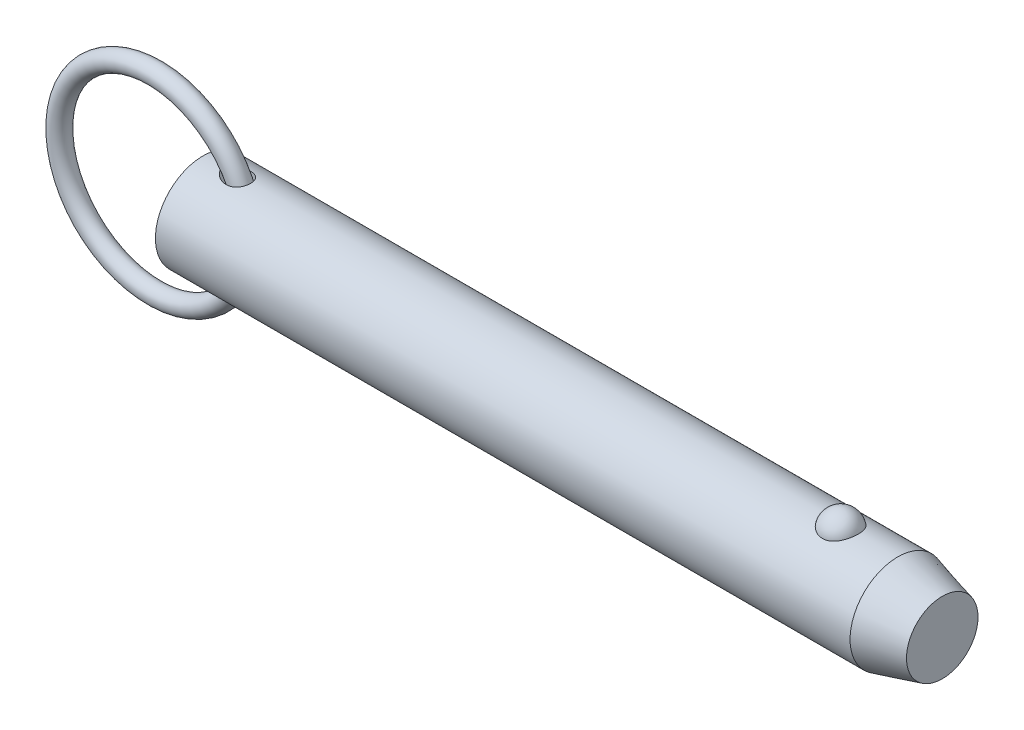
ISO-10303-21;
HEADER;
FILE_DESCRIPTION(('STEP AP214'),'2;1');
FILE_NAME('part.step','',(''),(''),'','','');
FILE_SCHEMA(('AUTOMOTIVE_DESIGN { 1 0 10303 214 1 1 1 1 }'));
ENDSEC;
DATA;
#1=APPLICATION_CONTEXT('core data for automotive mechanical design processes');
#2=APPLICATION_PROTOCOL_DEFINITION('international standard','automotive_design',2000,#1);
#3=PRODUCT_CONTEXT('',#1,'mechanical');
#4=PRODUCT('Part','Part','',(#3));
#5=PRODUCT_RELATED_PRODUCT_CATEGORY('part','',(#4));
#6=PRODUCT_DEFINITION_FORMATION('','',#4);
#7=PRODUCT_DEFINITION_CONTEXT('part definition',#1,'design');
#8=PRODUCT_DEFINITION('design','',#6,#7);
#9=PRODUCT_DEFINITION_SHAPE('','',#8);
#10=(LENGTH_UNIT() NAMED_UNIT(*) SI_UNIT(.MILLI.,.METRE.));
#11=(NAMED_UNIT(*) PLANE_ANGLE_UNIT() SI_UNIT($,.RADIAN.));
#12=(NAMED_UNIT(*) SI_UNIT($,.STERADIAN.) SOLID_ANGLE_UNIT());
#13=UNCERTAINTY_MEASURE_WITH_UNIT(LENGTH_MEASURE(1.E-05),#10,'distance_accuracy_value','');
#14=(GEOMETRIC_REPRESENTATION_CONTEXT(3) GLOBAL_UNCERTAINTY_ASSIGNED_CONTEXT((#13)) GLOBAL_UNIT_ASSIGNED_CONTEXT((#10,
#11,#12)) REPRESENTATION_CONTEXT('',''));
#15=CARTESIAN_POINT('',(0.,0.,0.));
#16=DIRECTION('',(0.,0.,1.));
#17=DIRECTION('',(1.,0.,0.));
#18=AXIS2_PLACEMENT_3D('',#15,#16,#17);
#19=CARTESIAN_POINT('',(-9.66825126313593,0.,0.));
#20=DIRECTION('',(0.,0.,1.));
#21=DIRECTION('',(1.,0.,0.));
#22=AXIS2_PLACEMENT_3D('',#19,#20,#21);
#23=TOROIDAL_SURFACE('',#22,19.05,1.905);
#24=CARTESIAN_POINT('',(11.2867487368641,0.,0.));
#25=VERTEX_POINT('',#24);
#26=VERTEX_LOOP('',#25);
#27=FACE_BOUND('',#26,.T.);
#28=ADVANCED_FACE('P0_F12',(#27),#23,.T.);
#29=CLOSED_SHELL('',(#28));
#30=MANIFOLD_SOLID_BREP('P0_B1',#29);
#31=CARTESIAN_POINT('',(0.,0.,0.));
#32=DIRECTION('',(1.,0.,0.));
#33=DIRECTION('',(0.,0.,-1.));
#34=AXIS2_PLACEMENT_3D('',#31,#32,#33);
#35=CYLINDRICAL_SURFACE('',#34,9.525);
#36=CARTESIAN_POINT('',(4.56693409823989,9.4314194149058,-1.33189820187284));
#37=CARTESIAN_POINT('',(4.70260475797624,9.41020313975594,-1.48215931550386));
#38=CARTESIAN_POINT('',(4.85555680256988,9.38755003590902,-1.61683982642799));
#39=CARTESIAN_POINT('',(5.10171959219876,9.35450554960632,-1.79512943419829));
#40=CARTESIAN_POINT('',(5.18674514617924,9.34362629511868,-1.85068909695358));
#41=CARTESIAN_POINT('',(5.36154389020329,9.32258514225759,-1.95392002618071));
#42=CARTESIAN_POINT('',(5.45131542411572,9.31242299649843,-2.00159402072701));
#43=CARTESIAN_POINT('',(5.70070211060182,9.28632120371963,-2.12033289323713));
#44=CARTESIAN_POINT('',(5.86420408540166,9.27146938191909,-2.18362944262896));
#45=CARTESIAN_POINT('',(6.19893345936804,9.24694163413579,-2.28525783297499));
#46=CARTESIAN_POINT('',(6.3701538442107,9.23726110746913,-2.32361187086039));
#47=CARTESIAN_POINT('',(6.73531776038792,9.22400982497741,-2.37575048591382));
#48=CARTESIAN_POINT('',(6.92975826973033,9.22118808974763,-2.38652934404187));
#49=CARTESIAN_POINT('',(7.21995443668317,9.22416297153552,-2.37494980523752));
#50=CARTESIAN_POINT('',(7.31643847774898,9.22635560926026,-2.366466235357));
#51=CARTESIAN_POINT('',(7.50796421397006,9.2331428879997,-2.33985028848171));
#52=CARTESIAN_POINT('',(7.60300650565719,9.23773650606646,-2.32172202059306));
#53=CARTESIAN_POINT('',(7.83273114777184,9.25183311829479,-2.26504721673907));
#54=CARTESIAN_POINT('',(7.96603028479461,9.26261470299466,-2.2209856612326));
#55=CARTESIAN_POINT('',(8.22310899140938,9.28816519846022,-2.1115730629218));
#56=CARTESIAN_POINT('',(8.34689477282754,9.30293147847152,-2.04623606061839));
#57=CARTESIAN_POINT('',(8.58136049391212,9.3349416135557,-1.89485344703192));
#58=CARTESIAN_POINT('',(8.69199721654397,9.35219324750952,-1.8087422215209));
#59=CARTESIAN_POINT('',(8.89592093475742,9.38707016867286,-1.6179918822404));
#60=CARTESIAN_POINT('',(8.98920771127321,9.40469546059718,-1.51335253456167));
#61=CARTESIAN_POINT('',(9.15057731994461,9.43713590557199,-1.29519427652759));
#62=CARTESIAN_POINT('',(9.21980158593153,9.45205440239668,-1.18253282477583));
#63=CARTESIAN_POINT('',(9.33826736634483,9.47856708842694,-0.946802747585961));
#64=CARTESIAN_POINT('',(9.38751161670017,9.49016173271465,-0.823735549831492));
#65=CARTESIAN_POINT('',(9.46423850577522,9.50859378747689,-0.572614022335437));
#66=CARTESIAN_POINT('',(9.4920239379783,9.5154972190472,-0.444656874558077));
#67=CARTESIAN_POINT('',(9.52636926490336,9.5240690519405,-0.185752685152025));
#68=CARTESIAN_POINT('',(9.5329292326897,9.52573747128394,-0.054805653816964));
#69=CARTESIAN_POINT('',(9.52467276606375,9.52365852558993,0.206503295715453));
#70=CARTESIAN_POINT('',(9.50983454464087,9.51990564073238,0.336864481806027));
#71=CARTESIAN_POINT('',(9.45907362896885,9.50737852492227,0.593166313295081));
#72=CARTESIAN_POINT('',(9.42315106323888,9.49860432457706,0.719106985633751));
#73=CARTESIAN_POINT('',(9.3310664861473,9.4769892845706,0.962959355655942));
#74=CARTESIAN_POINT('',(9.27490839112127,9.46414923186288,1.08087260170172));
#75=CARTESIAN_POINT('',(9.1437580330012,9.43581000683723,1.30534632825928));
#76=CARTESIAN_POINT('',(9.06876720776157,9.42031103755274,1.41190767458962));
#77=CARTESIAN_POINT('',(8.90203187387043,9.38836719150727,1.61069439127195));
#78=CARTESIAN_POINT('',(8.81029913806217,9.371922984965,1.70292975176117));
#79=CARTESIAN_POINT('',(8.6126877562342,9.33985045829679,1.87086859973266));
#80=CARTESIAN_POINT('',(8.50680947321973,9.3242221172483,1.94657251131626));
#81=CARTESIAN_POINT('',(8.28220546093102,9.29513431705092,2.08109032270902));
#82=CARTESIAN_POINT('',(8.16329919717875,9.28171415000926,2.13961034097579));
#83=CARTESIAN_POINT('',(7.91756052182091,9.25859072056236,2.23755716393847));
#84=CARTESIAN_POINT('',(7.79072606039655,9.24888842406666,2.27697900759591));
#85=CARTESIAN_POINT('',(7.52377913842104,9.23338749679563,2.33907806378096));
#86=CARTESIAN_POINT('',(7.3833476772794,9.22789571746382,2.36044900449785));
#87=CARTESIAN_POINT('',(7.1008139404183,9.22210229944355,2.3829751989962));
#88=CARTESIAN_POINT('',(6.95871103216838,9.22180269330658,2.38412253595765));
#89=CARTESIAN_POINT('',(6.65642691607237,9.22632724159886,2.36656230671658));
#90=CARTESIAN_POINT('',(6.49641694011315,9.23185415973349,2.3451317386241));
#91=CARTESIAN_POINT('',(6.18115433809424,9.24811737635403,2.28014143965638));
#92=CARTESIAN_POINT('',(6.02590710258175,9.25885936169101,2.23655754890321));
#93=CARTESIAN_POINT('',(5.69904720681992,9.28624254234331,2.12025087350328));
#94=CARTESIAN_POINT('',(5.52873601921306,9.30354853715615,2.04400672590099));
#95=CARTESIAN_POINT('',(5.20289495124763,9.34106989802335,1.86504730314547));
#96=CARTESIAN_POINT('',(5.0473596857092,9.36128419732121,1.76234172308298));
#97=CARTESIAN_POINT('',(4.79287124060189,9.39697639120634,1.55895334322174));
#98=CARTESIAN_POINT('',(4.6893870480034,9.41240250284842,1.46392900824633));
#99=CARTESIAN_POINT('',(4.4984714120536,9.44202586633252,1.25875918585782));
#100=CARTESIAN_POINT('',(4.41101129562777,9.45622528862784,1.1486413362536));
#101=CARTESIAN_POINT('',(4.27502257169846,9.47888210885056,0.94060098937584));
#102=CARTESIAN_POINT('',(4.22216329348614,9.48791121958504,0.845586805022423));
#103=CARTESIAN_POINT('',(4.13241478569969,9.50344321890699,0.648051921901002));
#104=CARTESIAN_POINT('',(4.09551182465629,9.50994827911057,0.545537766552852));
#105=CARTESIAN_POINT('',(4.04043124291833,9.51971586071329,0.334452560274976));
#106=CARTESIAN_POINT('',(4.0224072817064,9.52295176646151,0.225839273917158));
#107=CARTESIAN_POINT('',(4.00750873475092,9.52562364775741,0.00713006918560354));
#108=CARTESIAN_POINT('',(4.01062334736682,9.52506156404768,-0.102965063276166));
#109=CARTESIAN_POINT('',(4.03592967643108,9.52053221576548,-0.306944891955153));
#110=CARTESIAN_POINT('',(4.05571676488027,9.51699426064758,-0.401151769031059));
#111=CARTESIAN_POINT('',(4.10967975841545,9.5074546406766,-0.585176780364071));
#112=CARTESIAN_POINT('',(4.14385995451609,9.50145224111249,-0.674993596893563));
#113=CARTESIAN_POINT('',(4.23261356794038,9.48611703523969,-0.866116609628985));
#114=CARTESIAN_POINT('',(4.28990016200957,9.47635800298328,-0.966121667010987));
#115=CARTESIAN_POINT('',(4.4185657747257,9.45502867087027,-1.15640011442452));
#116=CARTESIAN_POINT('',(4.48996918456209,9.44345524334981,-1.24665623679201));
#117=CARTESIAN_POINT('',(4.56693409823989,9.4314194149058,-1.33189820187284));
#118=B_SPLINE_CURVE_WITH_KNOTS('',3,(#36,#37,#38,#39,#40,#41,#42,#43,#44,#45,#46,#47,#48,#49,
#50,#51,#52,#53,#54,#55,#56,#57,#58,#59,#60,#61,#62,#63,#64,#65,#66,#67,#68,#69,#70,#71,#72,#73,
#74,#75,#76,#77,#78,#79,#80,#81,#82,#83,#84,#85,#86,#87,#88,#89,#90,#91,#92,#93,#94,#95,#96,#97,
#98,#99,#100,#101,#102,#103,#104,#105,#106,#107,#108,#109,#110,#111,#112,#113,#114,#115,#116,
#117),.UNSPECIFIED.,.T.,.F.,(4,2,2,2,2,2,2,2,2,2,2,2,2,2,2,2,2,2,2,2,2,2,2,2,2,2,2,2,2,2,2,2,2,
2,2,2,2,2,2,2,4),(0.,0.609951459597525,0.916123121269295,1.22218863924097,1.74791337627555,
2.27316961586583,2.85362722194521,3.14383229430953,3.43391382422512,3.85437497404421,
4.27455920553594,4.69608835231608,5.11762282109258,5.51490051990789,5.91212379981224,
6.30363414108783,6.69514313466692,7.0870510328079,7.47895654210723,7.87078624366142,
8.26258603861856,8.65411137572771,9.0456266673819,9.44349251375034,9.84146165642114,
10.2662286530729,10.6911619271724,11.1739180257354,11.6572017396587,12.2170157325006,
12.776624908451,13.1992556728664,13.6211226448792,13.9471990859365,14.2729943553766,
14.6014211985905,14.9296802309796,15.2173810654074,15.505167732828,15.8505863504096,
16.1966070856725),.UNSPECIFIED.);
#119=CARTESIAN_POINT('',(4.56693409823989,9.4314194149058,-1.33189820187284));
#120=VERTEX_POINT('',#119);
#121=EDGE_CURVE('P1_E40',#120,#120,#118,.T.);
#122=ORIENTED_EDGE('',*,*,#121,.T.);
#123=EDGE_LOOP('',(#122));
#124=FACE_BOUND('',#123,.T.);
#125=CARTESIAN_POINT('',(138.743054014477,0.,0.));
#126=DIRECTION('',(1.,0.,0.));
#127=DIRECTION('',(0.,0.,-1.));
#128=AXIS2_PLACEMENT_3D('',#125,#126,#127);
#129=CIRCLE('',#128,9.525);
#130=CARTESIAN_POINT('',(138.743054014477,0.,-9.525));
#131=VERTEX_POINT('',#130);
#132=EDGE_CURVE('P1_E25',#131,#131,#129,.T.);
#133=ORIENTED_EDGE('',*,*,#132,.F.);
#134=EDGE_LOOP('',(#133));
#135=FACE_BOUND('',#134,.T.);
#136=CARTESIAN_POINT('',(0.,0.,0.));
#137=DIRECTION('',(1.,0.,0.));
#138=DIRECTION('',(0.,0.,-1.));
#139=AXIS2_PLACEMENT_3D('',#136,#137,#138);
#140=CIRCLE('',#139,9.525);
#141=CARTESIAN_POINT('',(0.,0.,-9.525));
#142=VERTEX_POINT('',#141);
#143=EDGE_CURVE('P1_E9',#142,#142,#140,.T.);
#144=ORIENTED_EDGE('',*,*,#143,.T.);
#145=EDGE_LOOP('',(#144));
#146=FACE_BOUND('',#145,.T.);
#147=CARTESIAN_POINT('',(127.345757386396,8.80405803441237,3.63513233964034));
#148=CARTESIAN_POINT('',(127.251676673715,8.80405953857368,3.63513053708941));
#149=CARTESIAN_POINT('',(127.157561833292,8.80561325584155,3.63137461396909));
#150=CARTESIAN_POINT('',(126.970012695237,8.81177748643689,3.61638665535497));
#151=CARTESIAN_POINT('',(126.876578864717,8.81638992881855,3.60514990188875));
#152=CARTESIAN_POINT('',(126.597945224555,8.83467114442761,3.56024627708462));
#153=CARTESIAN_POINT('',(126.414691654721,8.85278327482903,3.51538626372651));
#154=CARTESIAN_POINT('',(126.059509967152,8.89871214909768,3.39742145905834));
#155=CARTESIAN_POINT('',(125.887553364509,8.92650327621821,3.32439116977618));
#156=CARTESIAN_POINT('',(125.558707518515,8.98874819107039,3.15220244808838));
#157=CARTESIAN_POINT('',(125.401811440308,9.02319893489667,3.05305594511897));
#158=CARTESIAN_POINT('',(125.102214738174,9.09629186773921,2.82797815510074));
#159=CARTESIAN_POINT('',(124.960060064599,9.13502685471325,2.70135138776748));
#160=CARTESIAN_POINT('',(124.698299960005,9.2118657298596,2.42641932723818));
#161=CARTESIAN_POINT('',(124.578701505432,9.24996941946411,2.27810735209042));
#162=CARTESIAN_POINT('',(124.359645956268,9.32341082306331,1.95652290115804));
#163=CARTESIAN_POINT('',(124.261317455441,9.35855090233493,1.78243511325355));
#164=CARTESIAN_POINT('',(124.093819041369,9.42045142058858,1.41937246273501));
#165=CARTESIAN_POINT('',(124.024651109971,9.44721128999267,1.23039658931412));
#166=CARTESIAN_POINT('',(123.916199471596,9.48990641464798,0.840370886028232));
#167=CARTESIAN_POINT('',(123.877288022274,9.50570658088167,0.639202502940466));
#168=CARTESIAN_POINT('',(123.831555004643,9.52433146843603,0.232664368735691));
#169=CARTESIAN_POINT('',(123.824732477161,9.52715657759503,0.027294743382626));
#170=CARTESIAN_POINT('',(123.843255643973,9.51956918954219,-0.380478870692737));
#171=CARTESIAN_POINT('',(123.868405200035,9.50923740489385,-0.58289331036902));
#172=CARTESIAN_POINT('',(123.95002537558,9.47651897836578,-0.980293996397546));
#173=CARTESIAN_POINT('',(124.006496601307,9.45413210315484,-1.17528009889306));
#174=CARTESIAN_POINT('',(124.149719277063,9.39954044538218,-1.55263697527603));
#175=CARTESIAN_POINT('',(124.236512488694,9.36732213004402,-1.73498993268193));
#176=CARTESIAN_POINT('',(124.438610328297,9.29640700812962,-2.08177763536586));
#177=CARTESIAN_POINT('',(124.553917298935,9.25770966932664,-2.24621090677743));
#178=CARTESIAN_POINT('',(124.811264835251,9.17775604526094,-2.5533833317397));
#179=CARTESIAN_POINT('',(124.953434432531,9.136488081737,-2.696011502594));
#180=CARTESIAN_POINT('',(125.26089985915,9.05620497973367,-2.95451229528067));
#181=CARTESIAN_POINT('',(125.426193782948,9.01718965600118,-3.07038711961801));
#182=CARTESIAN_POINT('',(125.772052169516,8.94680019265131,-3.26976836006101));
#183=CARTESIAN_POINT('',(125.952227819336,8.91528408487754,-3.35389750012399));
#184=CARTESIAN_POINT('',(126.325651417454,8.86272514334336,-3.49043503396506));
#185=CARTESIAN_POINT('',(126.518894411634,8.84167836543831,-3.54285537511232));
#186=CARTESIAN_POINT('',(126.902503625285,8.81348056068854,-3.61241306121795));
#187=CARTESIAN_POINT('',(127.092525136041,8.80568348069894,-3.6311933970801));
#188=CARTESIAN_POINT('',(127.473190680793,8.80289410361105,-3.63795342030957));
#189=CARTESIAN_POINT('',(127.663834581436,8.80789922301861,-3.62593932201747));
#190=CARTESIAN_POINT('',(128.034007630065,8.82974915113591,-3.57238430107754));
#191=CARTESIAN_POINT('',(128.213697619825,8.84621463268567,-3.53178890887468));
#192=CARTESIAN_POINT('',(128.563422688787,8.88875330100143,-3.42331083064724));
#193=CARTESIAN_POINT('',(128.733456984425,8.91482726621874,-3.35542593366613));
#194=CARTESIAN_POINT('',(129.063237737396,8.97448239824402,-3.19248225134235));
#195=CARTESIAN_POINT('',(129.222680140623,9.00821446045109,-3.0968647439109));
#196=CARTESIAN_POINT('',(129.523513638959,9.07935398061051,-2.88162736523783));
#197=CARTESIAN_POINT('',(129.664900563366,9.11676228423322,-2.76200196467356));
#198=CARTESIAN_POINT('',(129.93331931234,9.19347419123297,-2.49516285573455));
#199=CARTESIAN_POINT('',(130.059275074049,9.23277872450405,-2.34686614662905));
#200=CARTESIAN_POINT('',(130.285522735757,9.3073761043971,-2.03093683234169));
#201=CARTESIAN_POINT('',(130.38581004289,9.34266823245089,-1.86330077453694));
#202=CARTESIAN_POINT('',(130.561514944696,9.40674710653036,-1.50744893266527));
#203=CARTESIAN_POINT('',(130.636041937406,9.43529176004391,-1.31874876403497));
#204=CARTESIAN_POINT('',(130.75416505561,9.48144132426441,-0.930631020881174));
#205=CARTESIAN_POINT('',(130.797760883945,9.49904612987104,-0.731213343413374));
#206=CARTESIAN_POINT('',(130.853158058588,9.5215314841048,-0.327147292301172));
#207=CARTESIAN_POINT('',(130.864935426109,9.52640243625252,-0.12249509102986));
#208=CARTESIAN_POINT('',(130.856382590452,9.5228957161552,0.286018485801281));
#209=CARTESIAN_POINT('',(130.83605305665,9.5145183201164,0.489879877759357));
#210=CARTESIAN_POINT('',(130.763884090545,9.48544083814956,0.88999431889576));
#211=CARTESIAN_POINT('',(130.712199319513,9.46480124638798,1.08627971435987));
#212=CARTESIAN_POINT('',(130.578491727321,9.4133389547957,1.46682086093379));
#213=CARTESIAN_POINT('',(130.496466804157,9.38251554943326,1.65107577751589));
#214=CARTESIAN_POINT('',(130.30319292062,9.31365636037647,2.00346348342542));
#215=CARTESIAN_POINT('',(130.191783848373,9.27558138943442,2.17150083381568));
#216=CARTESIAN_POINT('',(129.942294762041,9.19638714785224,2.48563115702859));
#217=CARTESIAN_POINT('',(129.804216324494,9.15526805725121,2.63172542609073));
#218=CARTESIAN_POINT('',(129.504843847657,9.07465393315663,2.89750997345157));
#219=CARTESIAN_POINT('',(129.343610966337,9.03515496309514,3.01726776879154));
#220=CARTESIAN_POINT('',(129.001613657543,8.96227564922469,3.22732920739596));
#221=CARTESIAN_POINT('',(128.820841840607,8.92889763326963,3.31762165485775));
#222=CARTESIAN_POINT('',(128.451445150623,8.8734538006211,3.46314419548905));
#223=CARTESIAN_POINT('',(128.26332371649,8.85102983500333,3.51950082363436));
#224=CARTESIAN_POINT('',(127.97578699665,8.82666967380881,3.57993683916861));
#225=CARTESIAN_POINT('',(127.879133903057,8.82009725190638,3.59606217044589));
#226=CARTESIAN_POINT('',(127.684677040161,8.81020897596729,3.62022512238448));
#227=CARTESIAN_POINT('',(127.586874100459,8.80689090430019,3.62826825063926));
#228=CARTESIAN_POINT('',(127.441224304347,8.80445615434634,3.63416760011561));
#229=CARTESIAN_POINT('',(127.393495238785,8.80405727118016,3.63513325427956));
#230=CARTESIAN_POINT('',(127.345757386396,8.80405803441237,3.63513233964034));
#231=B_SPLINE_CURVE_WITH_KNOTS('',3,(#147,#148,#149,#150,#151,#152,#153,#154,#155,#156,#157,
#158,#159,#160,#161,#162,#163,#164,#165,#166,#167,#168,#169,#170,#171,#172,#173,#174,#175,#176,
#177,#178,#179,#180,#181,#182,#183,#184,#185,#186,#187,#188,#189,#190,#191,#192,#193,#194,#195,
#196,#197,#198,#199,#200,#201,#202,#203,#204,#205,#206,#207,#208,#209,#210,#211,#212,#213,#214,
#215,#216,#217,#218,#219,#220,#221,#222,#223,#224,#225,#226,#227,#228,#229,#230),.UNSPECIFIED.,
.T.,.F.,(4,2,2,2,2,2,2,2,2,2,2,2,2,2,2,2,2,2,2,2,2,2,2,2,2,2,2,2,2,2,2,2,2,2,2,2,2,2,2,2,2,4),
(0.,0.282202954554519,0.564584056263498,1.13017050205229,1.69427128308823,2.25811483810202,
2.83836627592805,3.41879688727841,4.02497117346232,4.63118665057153,5.24474754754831,
5.85829010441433,6.46808687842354,7.07789545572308,7.68854723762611,8.29924920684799,
8.9129628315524,9.52662591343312,10.1275338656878,10.7282152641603,11.2986646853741,
11.8689989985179,12.4213015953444,12.973648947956,13.5380053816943,14.1024919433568,
14.695298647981,15.2882113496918,15.8999469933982,16.5116885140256,17.1238909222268,
17.7360805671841,18.3452748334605,18.9545113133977,19.567138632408,20.179729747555,
20.7907316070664,21.4019653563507,21.9915938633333,22.2859053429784,22.5800161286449,
22.7232098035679),.UNSPECIFIED.);
#232=CARTESIAN_POINT('',(127.345757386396,8.80405803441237,3.63513233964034));
#233=VERTEX_POINT('',#232);
#234=EDGE_CURVE('P1_E34',#233,#233,#231,.T.);
#235=ORIENTED_EDGE('',*,*,#234,.T.);
#236=EDGE_LOOP('',(#235));
#237=FACE_BOUND('',#236,.T.);
#238=CARTESIAN_POINT('',(4.56693409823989,-9.4314194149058,-1.33189820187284));
#239=CARTESIAN_POINT('',(4.48932984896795,-9.4435553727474,-1.24594548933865));
#240=CARTESIAN_POINT('',(4.41737309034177,-9.45522193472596,-1.1548795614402));
#241=CARTESIAN_POINT('',(4.2878104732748,-9.47670896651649,-0.962782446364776));
#242=CARTESIAN_POINT('',(4.23019403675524,-9.48653079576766,-0.861758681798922));
#243=CARTESIAN_POINT('',(4.13254559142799,-9.5034118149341,-0.649723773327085));
#244=CARTESIAN_POINT('',(4.09271158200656,-9.51043980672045,-0.538615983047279));
#245=CARTESIAN_POINT('',(4.04973167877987,-9.51806966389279,-0.367764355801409));
#246=CARTESIAN_POINT('',(4.03820037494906,-9.52012756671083,-0.310118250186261));
#247=CARTESIAN_POINT('',(4.02100287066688,-9.52320274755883,-0.193935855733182));
#248=CARTESIAN_POINT('',(4.01533565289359,-9.52422020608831,-0.135399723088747));
#249=CARTESIAN_POINT('',(4.0081707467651,-9.52550497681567,0.0247266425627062));
#250=CARTESIAN_POINT('',(4.01270492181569,-9.52468821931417,0.126661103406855));
#251=CARTESIAN_POINT('',(4.03954973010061,-9.51988506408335,0.328012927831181));
#252=CARTESIAN_POINT('',(4.06186450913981,-9.51589792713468,0.427429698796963));
#253=CARTESIAN_POINT('',(4.12088980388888,-9.50548528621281,0.616362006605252));
#254=CARTESIAN_POINT('',(4.15684838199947,-9.49918763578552,0.706123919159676));
#255=CARTESIAN_POINT('',(4.24094647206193,-9.48470618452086,0.879522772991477));
#256=CARTESIAN_POINT('',(4.28909090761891,-9.47652162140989,0.963157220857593));
#257=CARTESIAN_POINT('',(4.42295891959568,-9.45426317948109,1.16513741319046));
#258=CARTESIAN_POINT('',(4.51523752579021,-9.43933320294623,1.27905352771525));
#259=CARTESIAN_POINT('',(4.71682295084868,-9.40825940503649,1.49055892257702));
#260=CARTESIAN_POINT('',(4.82617286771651,-9.39211256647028,1.58810554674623));
#261=CARTESIAN_POINT('',(5.09064226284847,-9.35555264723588,1.79246125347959));
#262=CARTESIAN_POINT('',(5.2499041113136,-9.33524115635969,1.89393122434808));
#263=CARTESIAN_POINT('',(5.58309255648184,-9.29785396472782,2.06968659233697));
#264=CARTESIAN_POINT('',(5.7570289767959,-9.28078045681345,2.14395359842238));
#265=CARTESIAN_POINT('',(6.11646882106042,-9.25213303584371,2.26440412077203));
#266=CARTESIAN_POINT('',(6.30205582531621,-9.2406056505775,2.31035092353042));
#267=CARTESIAN_POINT('',(6.67856093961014,-9.22541807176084,2.37029728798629));
#268=CARTESIAN_POINT('',(6.8694704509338,-9.2217458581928,2.3843456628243));
#269=CARTESIAN_POINT('',(7.21217144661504,-9.2234423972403,2.37775005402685));
#270=CARTESIAN_POINT('',(7.36409439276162,-9.22713860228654,2.36352577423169));
#271=CARTESIAN_POINT('',(7.66346227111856,-9.24048072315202,2.31082299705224));
#272=CARTESIAN_POINT('',(7.81090958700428,-9.25012341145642,2.27235765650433));
#273=CARTESIAN_POINT('',(8.09730316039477,-9.2746609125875,2.17003648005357));
#274=CARTESIAN_POINT('',(8.23619652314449,-9.28958517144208,2.10603803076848));
#275=CARTESIAN_POINT('',(8.49918675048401,-9.32290326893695,1.95324442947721));
#276=CARTESIAN_POINT('',(8.62328895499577,-9.34129584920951,1.86445826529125));
#277=CARTESIAN_POINT('',(8.84006515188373,-9.37706953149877,1.67466761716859));
#278=CARTESIAN_POINT('',(8.93465172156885,-9.39436331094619,1.57582357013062));
#279=CARTESIAN_POINT('',(9.1049023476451,-9.42761680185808,1.362809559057));
#280=CARTESIAN_POINT('',(9.18057146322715,-9.44357686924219,1.24864370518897));
#281=CARTESIAN_POINT('',(9.30789178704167,-9.47159985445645,1.01379272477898));
#282=CARTESIAN_POINT('',(9.36045544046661,-9.48380365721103,0.893617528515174));
#283=CARTESIAN_POINT('',(9.44498362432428,-9.50388751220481,0.645890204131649));
#284=CARTESIAN_POINT('',(9.47694947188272,-9.51176784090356,0.518338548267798));
#285=CARTESIAN_POINT('',(9.51944262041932,-9.52232073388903,0.260103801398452));
#286=CARTESIAN_POINT('',(9.53006646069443,-9.52501674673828,0.129437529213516));
#287=CARTESIAN_POINT('',(9.52993291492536,-9.52498309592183,-0.131885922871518));
#288=CARTESIAN_POINT('',(9.5191752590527,-9.52225336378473,-0.262543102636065));
#289=CARTESIAN_POINT('',(9.47648788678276,-9.51165418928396,-0.520312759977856));
#290=CARTESIAN_POINT('',(9.44453086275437,-9.50377811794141,-0.647420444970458));
#291=CARTESIAN_POINT('',(9.36015568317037,-9.48373425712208,-0.894290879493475));
#292=CARTESIAN_POINT('',(9.30773827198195,-9.47156662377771,-1.01405389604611));
#293=CARTESIAN_POINT('',(9.18380895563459,-9.44428888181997,-1.24269386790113));
#294=CARTESIAN_POINT('',(9.11232064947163,-9.42918241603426,-1.35158405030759));
#295=CARTESIAN_POINT('',(8.95212687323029,-9.39767706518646,-1.55562459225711));
#296=CARTESIAN_POINT('',(8.86342281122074,-9.3812782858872,-1.65077607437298));
#297=CARTESIAN_POINT('',(8.6710444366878,-9.34891827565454,-1.8251751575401));
#298=CARTESIAN_POINT('',(8.56732858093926,-9.33295841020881,-1.90437711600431));
#299=CARTESIAN_POINT('',(8.34818438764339,-9.30317889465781,-2.0449122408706));
#300=CARTESIAN_POINT('',(8.23275529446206,-9.28935938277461,-2.10624425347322));
#301=CARTESIAN_POINT('',(7.98961240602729,-9.26475003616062,-2.2120340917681));
#302=CARTESIAN_POINT('',(7.86162088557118,-9.25407358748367,-2.25587700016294));
#303=CARTESIAN_POINT('',(7.60027499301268,-9.23720810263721,-2.32397032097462));
#304=CARTESIAN_POINT('',(7.46691858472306,-9.23102078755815,-2.34821321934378));
#305=CARTESIAN_POINT('',(7.18516230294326,-9.22302718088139,-2.37943079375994));
#306=CARTESIAN_POINT('',(7.03654454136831,-9.22169704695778,-2.38452997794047));
#307=CARTESIAN_POINT('',(6.7401504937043,-9.22442327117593,-2.37395141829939));
#308=CARTESIAN_POINT('',(6.59237455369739,-9.22848170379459,-2.35826567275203));
#309=CARTESIAN_POINT('',(6.27762777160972,-9.2422287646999,-2.30385559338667));
#310=CARTESIAN_POINT('',(6.11124715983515,-9.25269504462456,-2.26192683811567));
#311=CARTESIAN_POINT('',(5.78635920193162,-9.27830776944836,-2.15445569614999));
#312=CARTESIAN_POINT('',(5.62786567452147,-9.29346211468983,-2.08887341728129));
#313=CARTESIAN_POINT('',(5.39013065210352,-9.31931237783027,-1.96924953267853));
#314=CARTESIAN_POINT('',(5.30683088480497,-9.32901725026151,-1.92292485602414));
#315=CARTESIAN_POINT('',(5.1445580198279,-9.34899035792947,-1.82334419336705));
#316=CARTESIAN_POINT('',(5.06558607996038,-9.35925874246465,-1.77008636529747));
#317=CARTESIAN_POINT('',(4.83670950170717,-9.39034445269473,-1.60010986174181));
#318=CARTESIAN_POINT('',(4.69422471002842,-9.41151337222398,-1.47288240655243));
#319=CARTESIAN_POINT('',(4.56693409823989,-9.4314194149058,-1.33189820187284));
#320=B_SPLINE_CURVE_WITH_KNOTS('',3,(#238,#239,#240,#241,#242,#243,#244,#245,#246,#247,#248,
#249,#250,#251,#252,#253,#254,#255,#256,#257,#258,#259,#260,#261,#262,#263,#264,#265,#266,#267,
#268,#269,#270,#271,#272,#273,#274,#275,#276,#277,#278,#279,#280,#281,#282,#283,#284,#285,#286,
#287,#288,#289,#290,#291,#292,#293,#294,#295,#296,#297,#298,#299,#300,#301,#302,#303,#304,#305,
#306,#307,#308,#309,#310,#311,#312,#313,#314,#315,#316,#317,#318,#319),.UNSPECIFIED.,.T.,.F.,(4,
2,2,2,2,2,2,2,2,2,2,2,2,2,2,2,2,2,2,2,2,2,2,2,2,2,2,2,2,2,2,2,2,2,2,2,2,2,2,2,4),(0.,
0.348900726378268,0.697543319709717,1.0499765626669,1.22617690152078,1.40234666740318,
1.70666745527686,2.01105922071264,2.30066493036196,2.59038784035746,3.03001384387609,
3.4707682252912,4.03766594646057,4.60494622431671,5.17690598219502,5.74798989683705,
6.20400848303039,6.65977977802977,7.11813321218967,7.57632066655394,7.98791759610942,
8.39940433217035,8.79273459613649,9.18603970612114,9.57756168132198,9.96908859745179,
10.3611208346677,10.7531388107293,11.1446739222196,11.536177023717,11.9287850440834,
12.3214184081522,12.7268448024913,13.1324265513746,13.5768390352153,14.0214226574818,
14.5351685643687,15.0497849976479,15.3368801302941,15.6240516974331,16.1963372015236),.UNSPECIFIED.);
#321=CARTESIAN_POINT('',(4.56693409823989,-9.4314194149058,-1.33189820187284));
#322=VERTEX_POINT('',#321);
#323=EDGE_CURVE('P1_E17',#322,#322,#320,.T.);
#324=ORIENTED_EDGE('',*,*,#323,.T.);
#325=EDGE_LOOP('',(#324));
#326=FACE_BOUND('',#325,.T.);
#327=ADVANCED_FACE('P1_F13',(#124,#135,#146,#237,#326),#35,.T.);
#328=CARTESIAN_POINT('',(0.,0.,0.));
#329=DIRECTION('',(-1.,0.,0.));
#330=DIRECTION('',(0.,0.,1.));
#331=AXIS2_PLACEMENT_3D('',#328,#329,#330);
#332=PLANE('',#331);
#333=ORIENTED_EDGE('',*,*,#143,.F.);
#334=EDGE_LOOP('',(#333));
#335=FACE_BOUND('',#334,.T.);
#336=ADVANCED_FACE('P1_F15',(#335),#332,.T.);
#337=CARTESIAN_POINT('',(147.63,0.,0.));
#338=DIRECTION('',(-1.,0.,0.));
#339=DIRECTION('',(0.,0.,1.));
#340=AXIS2_PLACEMENT_3D('',#337,#338,#339);
#341=CONICAL_SURFACE('',#340,7.14375000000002,0.26179938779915);
#342=ORIENTED_EDGE('',*,*,#132,.T.);
#343=EDGE_LOOP('',(#342));
#344=FACE_BOUND('',#343,.T.);
#345=CARTESIAN_POINT('',(147.63,0.,0.));
#346=DIRECTION('',(1.,0.,0.));
#347=DIRECTION('',(0.,0.,-1.));
#348=AXIS2_PLACEMENT_3D('',#345,#346,#347);
#349=CIRCLE('',#348,7.14375000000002);
#350=CARTESIAN_POINT('',(147.63,0.,-7.14375000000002));
#351=VERTEX_POINT('',#350);
#352=EDGE_CURVE('P1_E30',#351,#351,#349,.T.);
#353=ORIENTED_EDGE('',*,*,#352,.F.);
#354=EDGE_LOOP('',(#353));
#355=FACE_BOUND('',#354,.T.);
#356=ADVANCED_FACE('P1_F55',(#344,#355),#341,.T.);
#357=CARTESIAN_POINT('',(147.63,7.14375000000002,0.));
#358=DIRECTION('',(1.,0.,0.));
#359=DIRECTION('',(0.,0.,-1.));
#360=AXIS2_PLACEMENT_3D('',#357,#358,#359);
#361=PLANE('',#360);
#362=ORIENTED_EDGE('',*,*,#352,.T.);
#363=EDGE_LOOP('',(#362));
#364=FACE_BOUND('',#363,.T.);
#365=ADVANCED_FACE('P1_F51',(#364),#361,.T.);
#366=CARTESIAN_POINT('',(127.345757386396,8.5725,0.));
#367=DIRECTION('',(-1.,0.,0.));
#368=DIRECTION('',(0.,1.,0.));
#369=AXIS2_PLACEMENT_3D('',#366,#367,#368);
#370=SPHERICAL_SURFACE('',#369,3.64249999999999);
#371=ORIENTED_EDGE('',*,*,#234,.F.);
#372=EDGE_LOOP('',(#371));
#373=FACE_BOUND('',#372,.T.);
#374=ADVANCED_FACE('P1_F46',(#373),#370,.T.);
#375=CARTESIAN_POINT('',(-9.66825126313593,0.,0.));
#376=DIRECTION('',(0.,0.,1.));
#377=DIRECTION('',(1.,0.,0.));
#378=AXIS2_PLACEMENT_3D('',#375,#376,#377);
#379=TOROIDAL_SURFACE('',#378,19.05,2.38125);
#380=ORIENTED_EDGE('',*,*,#323,.F.);
#381=EDGE_LOOP('',(#380));
#382=FACE_BOUND('',#381,.T.);
#383=ORIENTED_EDGE('',*,*,#121,.F.);
#384=EDGE_LOOP('',(#383));
#385=FACE_BOUND('',#384,.T.);
#386=ADVANCED_FACE('P1_F50',(#382,#385),#379,.F.);
#387=CLOSED_SHELL('',(#327,#336,#356,#365,#374,#386));
#388=MANIFOLD_SOLID_BREP('P1_B1',#387);
#389=ADVANCED_BREP_SHAPE_REPRESENTATION('',(#18,#30,#388),#14);
#390=SHAPE_DEFINITION_REPRESENTATION(#9,#389);
ENDSEC;
END-ISO-10303-21;
